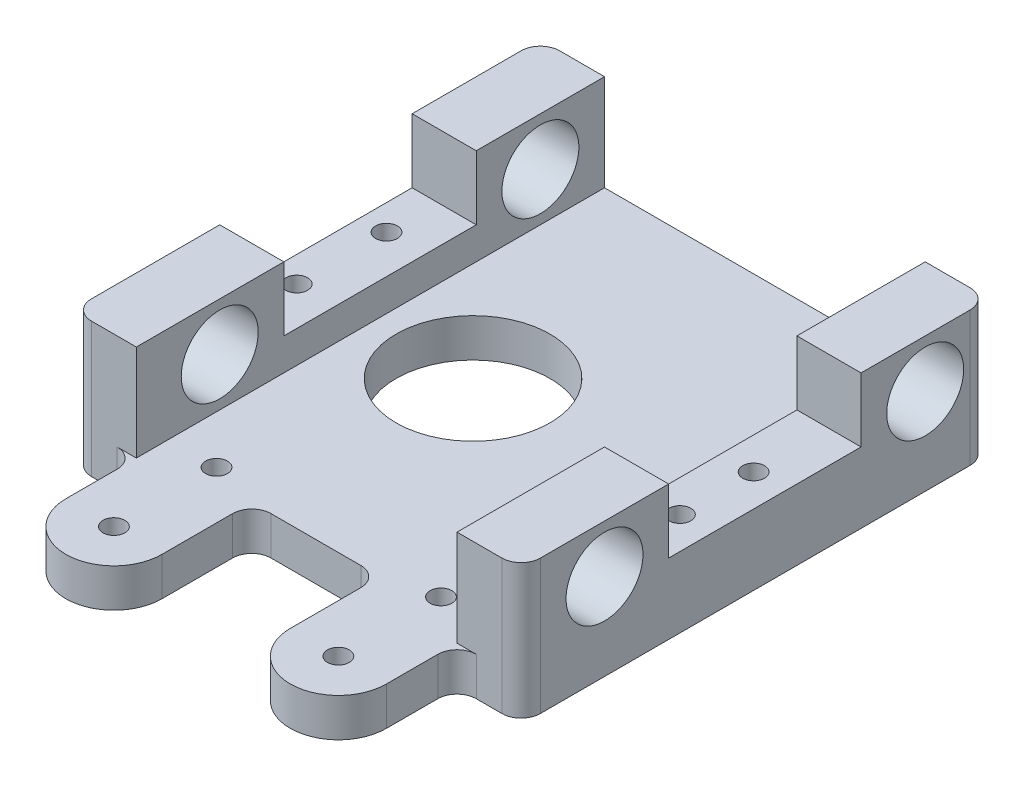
from build123d import *

# Parameters (mm, degrees)
ESQUISSE1_R             = 12
BOSS_EXTRU_1_DEPTH      = 6
ESQUISSE3_W             = 10
ESQUISSE3_H             = 73
BOSS_EXTRU_2_DEPTH      = 15
ESQUISSE4_R             = 6
ESQUISSE4_W             = 30
ESQUISSE4_H             = 10
ENL_V_MAT_EXTRU_1_DEPTH = 118.103586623
D_GAGEMENT_M32_D        = 3.4
CONG_2_R                = 3


with BuildPart() as part:
    # Esquisse1 → Boss.-Extru.1 (new body)
    with BuildSketch(Plane(origin=(0, 0, 0), x_dir=(1, 0, 0), z_dir=(0, 1, 0))):
        with BuildLine():
            Line((0, 0), (70, 0))
            Line((70, 0), (70, -73))
            Line((70, -73), (60, -73))
            Line((60, -73), (60, -84))
            ThreePointArc((60, -84), (52.5, -91.5), (45, -84))
            Line((45, -84), (45, -70))
            Line((45, -70), (25, -70))
            Line((25, -70), (25, -84))
            ThreePointArc((25, -84), (17.5, -91.5), (10, -84))
            Line((10, -84), (10, -73))
            Line((10, -73), (0, -73))
            Line((0, -73), (0, 0))
        make_face()
        with Locations(Location((25.5, -36, 0), (0, 0, 270))):
            Circle(ESQUISSE1_R, mode=Mode.SUBTRACT)
    extrude(amount=BOSS_EXTRU_1_DEPTH)

    # Esquisse3 → Boss.-Extru.2 (add)
    with BuildSketch(Plane(origin=(0, 6, 0), x_dir=(1, 0, 0), z_dir=(0, 1, 0))):
        with Locations((5, -36.5)):
            Rectangle(ESQUISSE3_W, ESQUISSE3_H)
        with Locations((65, -36.5)):
            Rectangle(ESQUISSE3_W, ESQUISSE3_H)
    extrude(amount=BOSS_EXTRU_2_DEPTH)

    # Esquisse4 → Enl_v. mat.-Extru.1 (cut, through all)
    with BuildSketch(Plane(origin=(0, 0, 0), x_dir=(0, 0, -1), z_dir=(1, 0, 0))):
        with Locations((-60, 13.5)):
            Circle(ESQUISSE4_R)
        with Locations((-10, 13.5)):
            Circle(ESQUISSE4_R)
        with Locations((-35, 16)):
            Rectangle(ESQUISSE4_W, ESQUISSE4_H)
    extrude(amount=ENL_V_MAT_EXTRU_1_DEPTH, mode=Mode.SUBTRACT)

    # D_gagement M32 (through all)
    with Locations(Plane(origin=(0, 11, 0), x_dir=(1, 0, 0), z_dir=(0, 1, 0))):
        with Locations((4, -28), (4, -42), (17.5, -84), (52.5, -84), (17.5, -68), (52.5, -68), (65, -31.75), (65, -43.25)):
            Hole(D_GAGEMENT_M32_D / 2)

    # Cong_2
    cong_2_edges = [part.edges().sort_by_distance(p)[0] for p in [
        (0, 10.5, 0),
        (70, 10.5, 0),
        (70, 10.5, 73),
        (60, 3, 73),
        (45, 3, 70),
        (25, 3, 70),
        (10, 3, 73),
        (0, 10.5, 73),
    ]]
    fillet(cong_2_edges, radius=CONG_2_R)


solid = part.part
